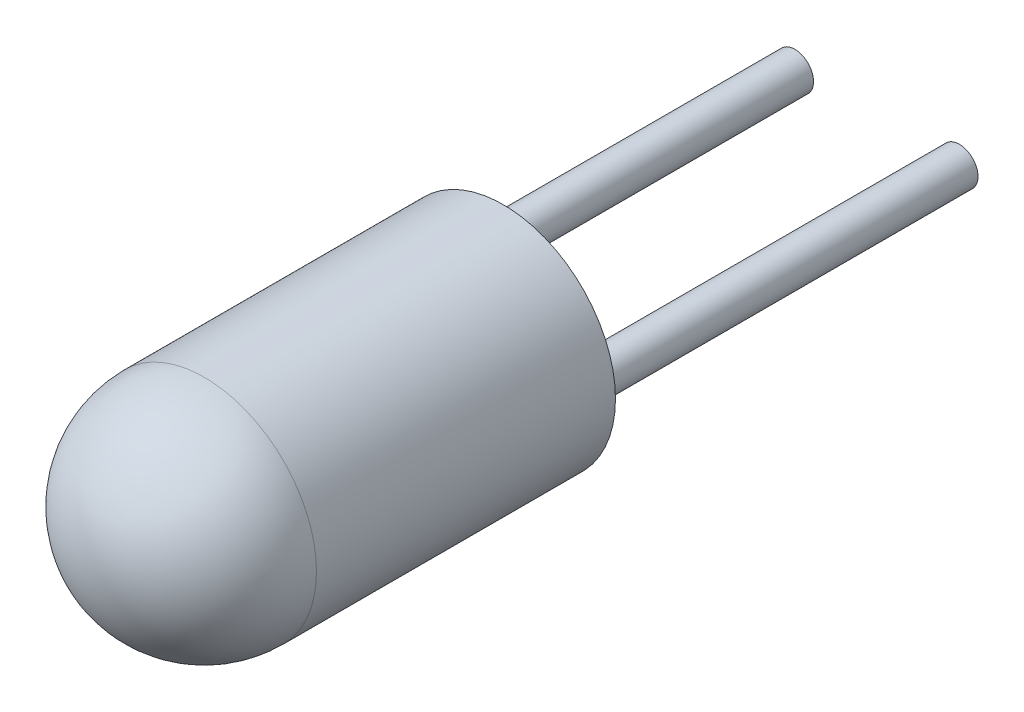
from build123d import *

# Parameters (mm, degrees)
ESQUISSE1_R       = 1.5
EXTRUSION1_DEPTH  = 4
D_ME1_FACE_RADIUS = 1.5
D_ME1_HEIGHT      = 1.5
ESQUISSE2_R       = 0.25
EXTRUSION2_DEPTH  = 5


with BuildPart() as part:
    # Esquisse1 → Extrusion1 (new body)
    with BuildSketch(Plane.XY):
        Circle(ESQUISSE1_R)
    extrude(amount=EXTRUSION1_DEPTH)

    # D_me1: a dome of height H over a round flat face of radius A is a cap of a sphere of radius (A * A + H * H) / (2 * H)
    d_me1_r = (D_ME1_FACE_RADIUS * D_ME1_FACE_RADIUS + D_ME1_HEIGHT * D_ME1_HEIGHT) / (2 * D_ME1_HEIGHT)
    d_me1_base = Plane((0, 0, 4), z_dir=(0, 0, 1))
    with Locations(d_me1_base.offset(D_ME1_HEIGHT - d_me1_r)):
        d_me1_ball = Sphere(d_me1_r, mode=Mode.PRIVATE)
    add(split(d_me1_ball, bisect_by=d_me1_base, keep=Keep.TOP, mode=Mode.PRIVATE))

    # Esquisse2 → Extrusion2 (add)
    with BuildSketch(Plane(origin=(0, 0, 0), x_dir=(-1, 0, 0), z_dir=(0, 0, -1))):
        with Locations(Location((1.1, 0, 0), (0, 0, 180))):
            Circle(ESQUISSE2_R)
        with Locations(Location((-1.1, 0, 0), (0, 0, 180))):
            Circle(ESQUISSE2_R)
    extrude(amount=EXTRUSION2_DEPTH)


solid = part.part
